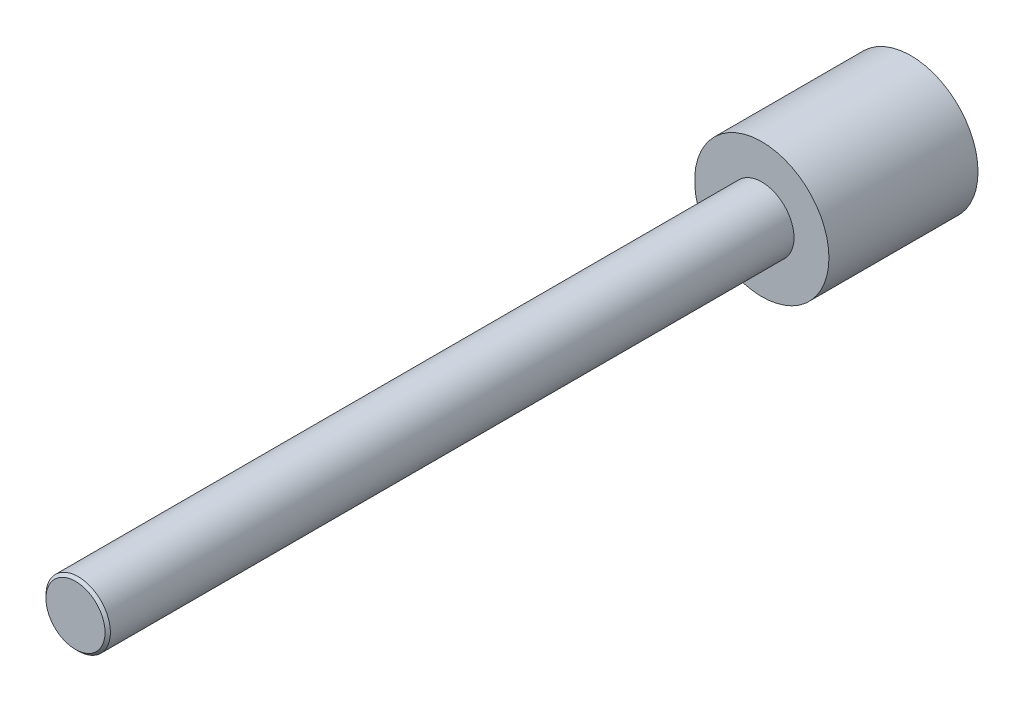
ISO-10303-21;
HEADER;
FILE_DESCRIPTION(('STEP AP214'),'2;1');
FILE_NAME('part.step','',(''),(''),'','','');
FILE_SCHEMA(('AUTOMOTIVE_DESIGN { 1 0 10303 214 1 1 1 1 }'));
ENDSEC;
DATA;
#1=APPLICATION_CONTEXT('core data for automotive mechanical design processes');
#2=APPLICATION_PROTOCOL_DEFINITION('international standard','automotive_design',2000,#1);
#3=PRODUCT_CONTEXT('',#1,'mechanical');
#4=PRODUCT('Part','Part','',(#3));
#5=PRODUCT_RELATED_PRODUCT_CATEGORY('part','',(#4));
#6=PRODUCT_DEFINITION_FORMATION('','',#4);
#7=PRODUCT_DEFINITION_CONTEXT('part definition',#1,'design');
#8=PRODUCT_DEFINITION('design','',#6,#7);
#9=PRODUCT_DEFINITION_SHAPE('','',#8);
#10=(LENGTH_UNIT() NAMED_UNIT(*) SI_UNIT(.MILLI.,.METRE.));
#11=(NAMED_UNIT(*) PLANE_ANGLE_UNIT() SI_UNIT($,.RADIAN.));
#12=(NAMED_UNIT(*) SI_UNIT($,.STERADIAN.) SOLID_ANGLE_UNIT());
#13=UNCERTAINTY_MEASURE_WITH_UNIT(LENGTH_MEASURE(1.E-05),#10,'distance_accuracy_value','');
#14=(GEOMETRIC_REPRESENTATION_CONTEXT(3) GLOBAL_UNCERTAINTY_ASSIGNED_CONTEXT((#13)) GLOBAL_UNIT_ASSIGNED_CONTEXT((#10,
#11,#12)) REPRESENTATION_CONTEXT('',''));
#15=CARTESIAN_POINT('',(0.,0.,0.));
#16=DIRECTION('',(0.,0.,1.));
#17=DIRECTION('',(1.,0.,0.));
#18=AXIS2_PLACEMENT_3D('',#15,#16,#17);
#19=CARTESIAN_POINT('',(0.,0.,13.843));
#20=DIRECTION('',(0.,0.,1.));
#21=DIRECTION('',(1.,0.,0.));
#22=AXIS2_PLACEMENT_3D('',#19,#20,#21);
#23=PLANE('',#22);
#24=CARTESIAN_POINT('',(0.,0.,13.843));
#25=DIRECTION('',(0.,0.,1.));
#26=DIRECTION('',(1.,0.,0.));
#27=AXIS2_PLACEMENT_3D('',#24,#25,#26);
#28=CIRCLE('',#27,6.35);
#29=CARTESIAN_POINT('',(6.35,0.,13.843));
#30=VERTEX_POINT('',#29);
#31=EDGE_CURVE('E45',#30,#30,#28,.T.);
#32=ORIENTED_EDGE('',*,*,#31,.T.);
#33=EDGE_LOOP('',(#32));
#34=FACE_BOUND('',#33,.T.);
#35=CARTESIAN_POINT('',(0.,0.,13.843));
#36=DIRECTION('',(0.,0.,1.));
#37=DIRECTION('',(1.,0.,0.));
#38=AXIS2_PLACEMENT_3D('',#35,#36,#37);
#39=CIRCLE('',#38,3.048);
#40=CARTESIAN_POINT('',(3.048,0.,13.843));
#41=VERTEX_POINT('',#40);
#42=EDGE_CURVE('E41',#41,#41,#39,.T.);
#43=ORIENTED_EDGE('',*,*,#42,.F.);
#44=EDGE_LOOP('',(#43));
#45=FACE_BOUND('',#44,.T.);
#46=ADVANCED_FACE('F30',(#34,#45),#23,.T.);
#47=CARTESIAN_POINT('',(0.,0.,13.843));
#48=DIRECTION('',(0.,0.,-1.));
#49=DIRECTION('',(-1.,0.,0.));
#50=AXIS2_PLACEMENT_3D('',#47,#48,#49);
#51=CYLINDRICAL_SURFACE('',#50,6.35);
#52=ORIENTED_EDGE('',*,*,#31,.F.);
#53=EDGE_LOOP('',(#52));
#54=FACE_BOUND('',#53,.T.);
#55=CARTESIAN_POINT('',(0.,0.,-0.254));
#56=DIRECTION('',(0.,0.,1.));
#57=DIRECTION('',(1.,0.,0.));
#58=AXIS2_PLACEMENT_3D('',#55,#56,#57);
#59=CIRCLE('',#58,6.35);
#60=CARTESIAN_POINT('',(6.35,0.,-0.254));
#61=VERTEX_POINT('',#60);
#62=EDGE_CURVE('E48',#61,#61,#59,.T.);
#63=ORIENTED_EDGE('',*,*,#62,.T.);
#64=EDGE_LOOP('',(#63));
#65=FACE_BOUND('',#64,.T.);
#66=ADVANCED_FACE('F56',(#54,#65),#51,.T.);
#67=CARTESIAN_POINT('',(0.,0.,-0.254));
#68=DIRECTION('',(0.,0.,1.));
#69=DIRECTION('',(1.,0.,0.));
#70=AXIS2_PLACEMENT_3D('',#67,#68,#69);
#71=PLANE('',#70);
#72=ORIENTED_EDGE('',*,*,#62,.F.);
#73=EDGE_LOOP('',(#72));
#74=FACE_BOUND('',#73,.T.);
#75=ADVANCED_FACE('F59',(#74),#71,.F.);
#76=CARTESIAN_POINT('',(0.,0.,78.74));
#77=DIRECTION('',(0.,0.,-1.));
#78=DIRECTION('',(-1.,0.,0.));
#79=AXIS2_PLACEMENT_3D('',#76,#77,#78);
#80=CYLINDRICAL_SURFACE('',#79,3.048);
#81=CARTESIAN_POINT('',(0.,0.,78.486));
#82=DIRECTION('',(0.,0.,1.));
#83=DIRECTION('',(1.,0.,0.));
#84=AXIS2_PLACEMENT_3D('',#81,#82,#83);
#85=CIRCLE('',#84,3.048);
#86=CARTESIAN_POINT('',(3.048,0.,78.486));
#87=VERTEX_POINT('',#86);
#88=EDGE_CURVE('E10',#87,#87,#85,.F.);
#89=ORIENTED_EDGE('',*,*,#88,.T.);
#90=EDGE_LOOP('',(#89));
#91=FACE_BOUND('',#90,.T.);
#92=ORIENTED_EDGE('',*,*,#42,.T.);
#93=EDGE_LOOP('',(#92));
#94=FACE_BOUND('',#93,.T.);
#95=ADVANCED_FACE('F64',(#91,#94),#80,.T.);
#96=CARTESIAN_POINT('',(0.,0.,78.74));
#97=DIRECTION('',(0.,0.,1.));
#98=DIRECTION('',(1.,0.,0.));
#99=AXIS2_PLACEMENT_3D('',#96,#97,#98);
#100=PLANE('',#99);
#101=CARTESIAN_POINT('',(0.,0.,78.74));
#102=DIRECTION('',(0.,0.,1.));
#103=DIRECTION('',(1.,0.,0.));
#104=AXIS2_PLACEMENT_3D('',#101,#102,#103);
#105=CIRCLE('',#104,2.794);
#106=CARTESIAN_POINT('',(2.794,0.,78.74));
#107=VERTEX_POINT('',#106);
#108=EDGE_CURVE('E37',#107,#107,#105,.T.);
#109=ORIENTED_EDGE('',*,*,#108,.T.);
#110=EDGE_LOOP('',(#109));
#111=FACE_BOUND('',#110,.T.);
#112=ADVANCED_FACE('F69',(#111),#100,.T.);
#113=CARTESIAN_POINT('',(0.,0.,78.74));
#114=DIRECTION('',(0.,0.,-1.));
#115=DIRECTION('',(-1.,0.,0.));
#116=AXIS2_PLACEMENT_3D('',#113,#114,#115);
#117=CONICAL_SURFACE('',#116,2.794,0.785398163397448);
#118=ORIENTED_EDGE('',*,*,#88,.F.);
#119=EDGE_LOOP('',(#118));
#120=FACE_BOUND('',#119,.T.);
#121=ORIENTED_EDGE('',*,*,#108,.F.);
#122=EDGE_LOOP('',(#121));
#123=FACE_BOUND('',#122,.T.);
#124=ADVANCED_FACE('F32',(#120,#123),#117,.T.);
#125=CLOSED_SHELL('',(#46,#66,#75,#95,#112,#124));
#126=MANIFOLD_SOLID_BREP('B2',#125);
#127=ADVANCED_BREP_SHAPE_REPRESENTATION('',(#18,#126),#14);
#128=SHAPE_DEFINITION_REPRESENTATION(#9,#127);
ENDSEC;
END-ISO-10303-21;
